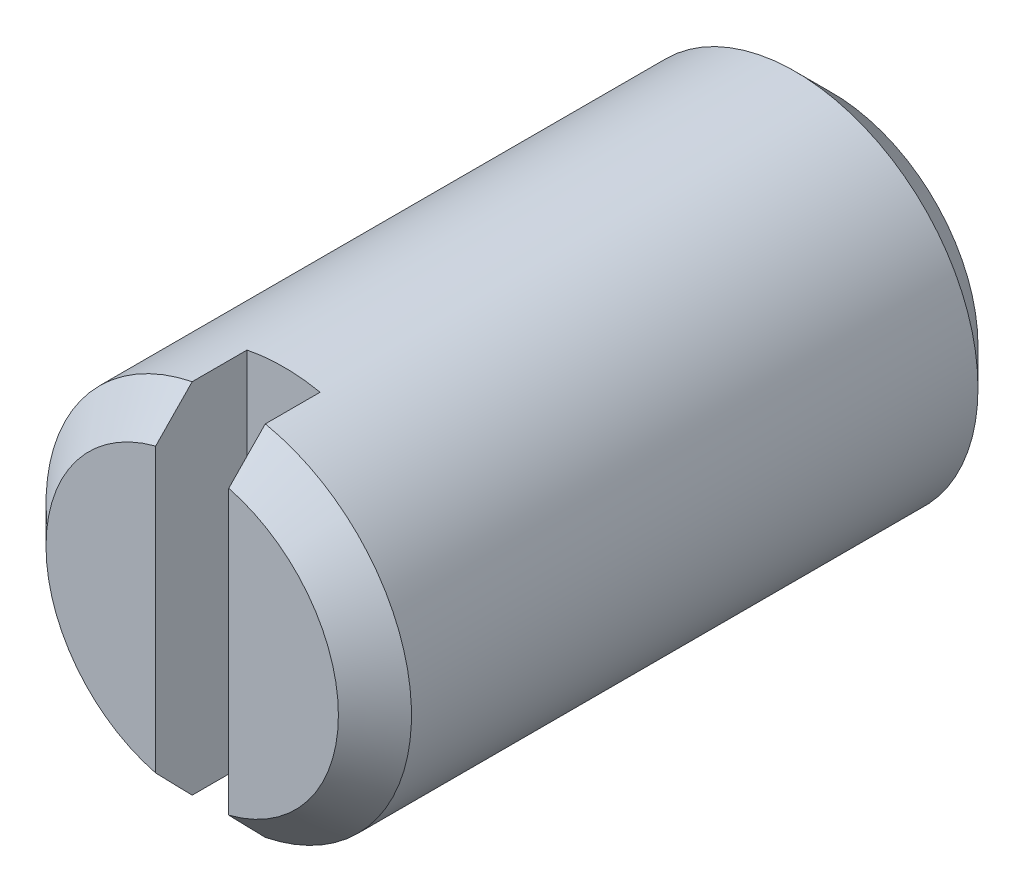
ISO-10303-21;
HEADER;
FILE_DESCRIPTION(('STEP AP214'),'2;1');
FILE_NAME('part.step','',(''),(''),'','','');
FILE_SCHEMA(('AUTOMOTIVE_DESIGN { 1 0 10303 214 1 1 1 1 }'));
ENDSEC;
DATA;
#1=APPLICATION_CONTEXT('core data for automotive mechanical design processes');
#2=APPLICATION_PROTOCOL_DEFINITION('international standard','automotive_design',2000,#1);
#3=PRODUCT_CONTEXT('',#1,'mechanical');
#4=PRODUCT('Part','Part','',(#3));
#5=PRODUCT_RELATED_PRODUCT_CATEGORY('part','',(#4));
#6=PRODUCT_DEFINITION_FORMATION('','',#4);
#7=PRODUCT_DEFINITION_CONTEXT('part definition',#1,'design');
#8=PRODUCT_DEFINITION('design','',#6,#7);
#9=PRODUCT_DEFINITION_SHAPE('','',#8);
#10=(LENGTH_UNIT() NAMED_UNIT(*) SI_UNIT(.MILLI.,.METRE.));
#11=(NAMED_UNIT(*) PLANE_ANGLE_UNIT() SI_UNIT($,.RADIAN.));
#12=(NAMED_UNIT(*) SI_UNIT($,.STERADIAN.) SOLID_ANGLE_UNIT());
#13=UNCERTAINTY_MEASURE_WITH_UNIT(LENGTH_MEASURE(1.E-05),#10,'distance_accuracy_value','');
#14=(GEOMETRIC_REPRESENTATION_CONTEXT(3) GLOBAL_UNCERTAINTY_ASSIGNED_CONTEXT((#13)) GLOBAL_UNIT_ASSIGNED_CONTEXT((#10,
#11,#12)) REPRESENTATION_CONTEXT('',''));
#15=CARTESIAN_POINT('',(0.,0.,0.));
#16=DIRECTION('',(0.,0.,1.));
#17=DIRECTION('',(1.,0.,0.));
#18=AXIS2_PLACEMENT_3D('',#15,#16,#17);
#19=CARTESIAN_POINT('',(0.,0.,3.5));
#20=DIRECTION('',(0.,0.,-1.));
#21=DIRECTION('',(-1.,0.,0.));
#22=AXIS2_PLACEMENT_3D('',#19,#20,#21);
#23=CYLINDRICAL_SURFACE('',#22,1.);
#24=CARTESIAN_POINT('',(0.,0.,0.200000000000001));
#25=DIRECTION('',(0.,0.,1.));
#26=DIRECTION('',(1.,0.,0.));
#27=AXIS2_PLACEMENT_3D('',#24,#25,#26);
#28=CIRCLE('',#27,1.);
#29=CARTESIAN_POINT('',(1.,0.,0.200000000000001));
#30=VERTEX_POINT('',#29);
#31=EDGE_CURVE('E147',#30,#30,#28,.T.);
#32=ORIENTED_EDGE('',*,*,#31,.T.);
#33=EDGE_LOOP('',(#32));
#34=FACE_BOUND('',#33,.T.);
#35=DIRECTION('',(0.,0.,-1.));
#36=VECTOR('',#35,1.);
#37=CARTESIAN_POINT('',(-0.2,0.979795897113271,3.5));
#38=LINE('',#37,#36);
#39=CARTESIAN_POINT('',(-0.2,0.979795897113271,3.));
#40=VERTEX_POINT('',#39);
#41=CARTESIAN_POINT('',(-0.2,0.979795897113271,3.3));
#42=VERTEX_POINT('',#41);
#43=EDGE_CURVE('E148',#40,#42,#38,.F.);
#44=ORIENTED_EDGE('',*,*,#43,.F.);
#45=CARTESIAN_POINT('',(0.,0.,3.));
#46=DIRECTION('',(0.,0.,1.));
#47=DIRECTION('',(1.,0.,0.));
#48=AXIS2_PLACEMENT_3D('',#45,#46,#47);
#49=CIRCLE('',#48,1.);
#50=CARTESIAN_POINT('',(0.2,0.979795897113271,3.));
#51=VERTEX_POINT('',#50);
#52=EDGE_CURVE('E11',#51,#40,#49,.T.);
#53=ORIENTED_EDGE('',*,*,#52,.F.);
#54=DIRECTION('',(0.,0.,-1.));
#55=VECTOR('',#54,1.);
#56=CARTESIAN_POINT('',(0.2,0.979795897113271,3.5));
#57=LINE('',#56,#55);
#58=CARTESIAN_POINT('',(0.2,0.979795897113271,3.3));
#59=VERTEX_POINT('',#58);
#60=EDGE_CURVE('E144',#59,#51,#57,.T.);
#61=ORIENTED_EDGE('',*,*,#60,.F.);
#62=CARTESIAN_POINT('',(0.,0.,3.3));
#63=DIRECTION('',(0.,0.,1.));
#64=DIRECTION('',(1.,0.,0.));
#65=AXIS2_PLACEMENT_3D('',#62,#63,#64);
#66=CIRCLE('',#65,1.);
#67=CARTESIAN_POINT('',(0.2,-0.979795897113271,3.3));
#68=VERTEX_POINT('',#67);
#69=EDGE_CURVE('E136',#59,#68,#66,.F.);
#70=ORIENTED_EDGE('',*,*,#69,.T.);
#71=DIRECTION('',(0.,0.,-1.));
#72=VECTOR('',#71,1.);
#73=CARTESIAN_POINT('',(0.2,-0.979795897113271,3.5));
#74=LINE('',#73,#72);
#75=CARTESIAN_POINT('',(0.2,-0.979795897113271,3.));
#76=VERTEX_POINT('',#75);
#77=EDGE_CURVE('E142',#76,#68,#74,.F.);
#78=ORIENTED_EDGE('',*,*,#77,.F.);
#79=CARTESIAN_POINT('',(-0.2,-0.979795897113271,3.));
#80=VERTEX_POINT('',#79);
#81=EDGE_CURVE('E32',#80,#76,#49,.T.);
#82=ORIENTED_EDGE('',*,*,#81,.F.);
#83=DIRECTION('',(0.,0.,-1.));
#84=VECTOR('',#83,1.);
#85=CARTESIAN_POINT('',(-0.2,-0.979795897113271,3.5));
#86=LINE('',#85,#84);
#87=CARTESIAN_POINT('',(-0.2,-0.979795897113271,3.3));
#88=VERTEX_POINT('',#87);
#89=EDGE_CURVE('E145',#88,#80,#86,.T.);
#90=ORIENTED_EDGE('',*,*,#89,.F.);
#91=EDGE_CURVE('E91',#88,#42,#66,.F.);
#92=ORIENTED_EDGE('',*,*,#91,.T.);
#93=EDGE_LOOP('',(#44,#53,#61,#70,#78,#82,#90,#92));
#94=FACE_BOUND('',#93,.T.);
#95=ADVANCED_FACE('F29',(#34,#94),#23,.T.);
#96=CARTESIAN_POINT('',(0.,0.,3.5));
#97=DIRECTION('',(0.,0.,1.));
#98=DIRECTION('',(1.,0.,0.));
#99=AXIS2_PLACEMENT_3D('',#96,#97,#98);
#100=PLANE('',#99);
#101=CARTESIAN_POINT('',(0.,0.,3.5));
#102=DIRECTION('',(0.,0.,1.));
#103=DIRECTION('',(1.,0.,0.));
#104=AXIS2_PLACEMENT_3D('',#101,#102,#103);
#105=CIRCLE('',#104,0.799999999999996);
#106=CARTESIAN_POINT('',(-0.2,0.77459666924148,3.5));
#107=VERTEX_POINT('',#106);
#108=CARTESIAN_POINT('',(-0.2,-0.77459666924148,3.5));
#109=VERTEX_POINT('',#108);
#110=EDGE_CURVE('E89',#107,#109,#105,.T.);
#111=ORIENTED_EDGE('',*,*,#110,.T.);
#112=DIRECTION('',(0.,1.,0.));
#113=VECTOR('',#112,1.);
#114=CARTESIAN_POINT('',(-0.2,-1.4,3.5));
#115=LINE('',#114,#113);
#116=EDGE_CURVE('E78',#109,#107,#115,.T.);
#117=ORIENTED_EDGE('',*,*,#116,.T.);
#118=EDGE_LOOP('',(#111,#117));
#119=FACE_BOUND('',#118,.T.);
#120=ADVANCED_FACE('F92',(#119),#100,.T.);
#121=CARTESIAN_POINT('',(0.2,-0.77459666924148,3.5));
#122=VERTEX_POINT('',#121);
#123=CARTESIAN_POINT('',(0.2,0.77459666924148,3.5));
#124=VERTEX_POINT('',#123);
#125=EDGE_CURVE('E94',#122,#124,#105,.T.);
#126=ORIENTED_EDGE('',*,*,#125,.T.);
#127=DIRECTION('',(0.,-1.,0.));
#128=VECTOR('',#127,1.);
#129=CARTESIAN_POINT('',(0.2,1.2,3.5));
#130=LINE('',#129,#128);
#131=EDGE_CURVE('E43',#124,#122,#130,.T.);
#132=ORIENTED_EDGE('',*,*,#131,.T.);
#133=EDGE_LOOP('',(#126,#132));
#134=FACE_BOUND('',#133,.T.);
#135=ADVANCED_FACE('F172',(#134),#100,.T.);
#136=CARTESIAN_POINT('',(0.,0.,3.5));
#137=DIRECTION('',(0.,0.,-1.));
#138=DIRECTION('',(-1.,0.,0.));
#139=AXIS2_PLACEMENT_3D('',#136,#137,#138);
#140=CONICAL_SURFACE('',#139,0.799999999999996,0.785398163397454);
#141=ORIENTED_EDGE('',*,*,#91,.F.);
#142=CARTESIAN_POINT('',(-0.2,-1.62590234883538,2.6618429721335));
#143=CARTESIAN_POINT('',(-0.2,-1.5636105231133,2.72366321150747));
#144=CARTESIAN_POINT('',(-0.2,-1.50129737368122,2.78546206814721));
#145=CARTESIAN_POINT('',(-0.2,-1.37659673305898,2.90897869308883));
#146=CARTESIAN_POINT('',(-0.2,-1.31420924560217,2.97069646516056));
#147=CARTESIAN_POINT('',(-0.2,-1.18933820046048,3.09400280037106));
#148=CARTESIAN_POINT('',(-0.2,-1.12685467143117,3.15559139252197));
#149=CARTESIAN_POINT('',(-0.2,-1.00170578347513,3.27859014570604));
#150=CARTESIAN_POINT('',(-0.2,-0.939040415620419,3.34000029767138));
#151=CARTESIAN_POINT('',(-0.2,-0.827245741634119,3.44898991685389));
#152=CARTESIAN_POINT('',(-0.2,-0.778178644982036,3.49663317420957));
#153=CARTESIAN_POINT('',(-0.2,-0.679728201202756,3.59158232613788));
#154=CARTESIAN_POINT('',(-0.2,-0.630344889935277,3.63888825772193));
#155=CARTESIAN_POINT('',(-0.2,-0.555796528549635,3.70936807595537));
#156=CARTESIAN_POINT('',(-0.2,-0.530862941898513,3.73278632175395));
#157=CARTESIAN_POINT('',(-0.2,-0.480767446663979,3.77937359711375));
#158=CARTESIAN_POINT('',(-0.2,-0.455605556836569,3.80254264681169));
#159=CARTESIAN_POINT('',(-0.2,-0.404921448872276,3.84850702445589));
#160=CARTESIAN_POINT('',(-0.2,-0.379399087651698,3.87130219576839));
#161=CARTESIAN_POINT('',(-0.2,-0.340679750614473,3.90500319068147));
#162=CARTESIAN_POINT('',(-0.2,-0.327698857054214,3.91615639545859));
#163=CARTESIAN_POINT('',(-0.2,-0.301538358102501,3.93823011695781));
#164=CARTESIAN_POINT('',(-0.2,-0.288358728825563,3.94915060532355));
#165=CARTESIAN_POINT('',(-0.2,-0.27505401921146,3.95991954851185));
#166=B_SPLINE_CURVE_WITH_KNOTS('',3,(#142,#143,#144,#145,#146,#147,#148,#149,#150,#151,#152,
#153,#154,#155,#156,#157,#158,#159,#160,#161,#162,#163,#164,#165),.UNSPECIFIED.,.F.,.F.,(4,2,2,
2,2,2,2,2,2,2,2,4),(0.,0.263283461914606,0.526554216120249,0.789757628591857,1.05297419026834,
1.25814953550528,1.46330201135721,1.56592093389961,1.66853150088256,1.77118401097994,
1.82252439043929,1.87387099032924),.UNSPECIFIED.);
#167=EDGE_CURVE('E51',#88,#109,#166,.T.);
#168=ORIENTED_EDGE('',*,*,#167,.T.);
#169=ORIENTED_EDGE('',*,*,#110,.F.);
#170=CARTESIAN_POINT('',(-0.2,0.27505401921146,3.95991954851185));
#171=CARTESIAN_POINT('',(-0.2,0.287984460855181,3.94945412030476));
#172=CARTESIAN_POINT('',(-0.2,0.30079644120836,3.93884505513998));
#173=CARTESIAN_POINT('',(-0.2,0.326231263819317,3.91740515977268));
#174=CARTESIAN_POINT('',(-0.2,0.33885412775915,3.90657435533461));
#175=CARTESIAN_POINT('',(-0.2,0.376508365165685,3.87384977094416));
#176=CARTESIAN_POINT('',(-0.2,0.401332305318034,3.85171810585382));
#177=CARTESIAN_POINT('',(-0.2,0.450630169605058,3.80709112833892));
#178=CARTESIAN_POINT('',(-0.2,0.475104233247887,3.78459596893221));
#179=CARTESIAN_POINT('',(-0.2,0.523828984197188,3.73936147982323));
#180=CARTESIAN_POINT('',(-0.2,0.548079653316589,3.71662213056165));
#181=CARTESIAN_POINT('',(-0.2,0.623380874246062,3.64554271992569));
#182=CARTESIAN_POINT('',(-0.2,0.674168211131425,3.59692435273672));
#183=CARTESIAN_POINT('',(-0.2,0.775409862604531,3.49932148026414));
#184=CARTESIAN_POINT('',(-0.2,0.825864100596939,3.45033689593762));
#185=CARTESIAN_POINT('',(-0.2,0.939066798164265,3.33997457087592));
#186=CARTESIAN_POINT('',(-0.2,1.00175843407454,3.27853855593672));
#187=CARTESIAN_POINT('',(-0.2,1.12696288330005,3.1554848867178));
#188=CARTESIAN_POINT('',(-0.2,1.1894756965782,3.0938672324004));
#189=CARTESIAN_POINT('',(-0.2,1.31434978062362,2.97055748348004));
#190=CARTESIAN_POINT('',(-0.2,1.37671112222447,2.90886546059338));
#191=CARTESIAN_POINT('',(-0.2,1.50135619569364,2.78540373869));
#192=CARTESIAN_POINT('',(-0.2,1.56363992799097,2.72363404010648));
#193=CARTESIAN_POINT('',(-0.2,1.62590234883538,2.6618429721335));
#194=B_SPLINE_CURVE_WITH_KNOTS('',3,(#170,#171,#172,#173,#174,#175,#176,#177,#178,#179,#180,
#181,#182,#183,#184,#185,#186,#187,#188,#189,#190,#191,#192,#193),.UNSPECIFIED.,.F.,.F.,(4,2,2,
2,2,2,2,2,2,2,2,4),(0.,0.0499013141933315,0.0997968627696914,0.199561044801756,
0.299284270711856,0.399015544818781,0.609932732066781,0.820896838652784,1.08422397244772,
1.34755116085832,1.6107118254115,1.87387102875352),.UNSPECIFIED.);
#195=EDGE_CURVE('E81',#107,#42,#194,.T.);
#196=ORIENTED_EDGE('',*,*,#195,.T.);
#197=EDGE_LOOP('',(#141,#168,#169,#196));
#198=FACE_BOUND('',#197,.T.);
#199=ADVANCED_FACE('F88',(#198),#140,.T.);
#200=ORIENTED_EDGE('',*,*,#125,.F.);
#201=CARTESIAN_POINT('',(0.2,-0.27505401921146,3.95991954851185));
#202=CARTESIAN_POINT('',(0.2,-0.287984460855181,3.94945412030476));
#203=CARTESIAN_POINT('',(0.2,-0.30079644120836,3.93884505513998));
#204=CARTESIAN_POINT('',(0.2,-0.326231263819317,3.91740515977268));
#205=CARTESIAN_POINT('',(0.2,-0.33885412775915,3.90657435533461));
#206=CARTESIAN_POINT('',(0.2,-0.376508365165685,3.87384977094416));
#207=CARTESIAN_POINT('',(0.2,-0.401332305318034,3.85171810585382));
#208=CARTESIAN_POINT('',(0.2,-0.450630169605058,3.80709112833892));
#209=CARTESIAN_POINT('',(0.2,-0.475104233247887,3.78459596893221));
#210=CARTESIAN_POINT('',(0.2,-0.523828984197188,3.73936147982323));
#211=CARTESIAN_POINT('',(0.2,-0.548079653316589,3.71662213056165));
#212=CARTESIAN_POINT('',(0.2,-0.623380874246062,3.64554271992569));
#213=CARTESIAN_POINT('',(0.2,-0.674168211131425,3.59692435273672));
#214=CARTESIAN_POINT('',(0.2,-0.775409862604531,3.49932148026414));
#215=CARTESIAN_POINT('',(0.2,-0.825864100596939,3.45033689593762));
#216=CARTESIAN_POINT('',(0.2,-0.939066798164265,3.33997457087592));
#217=CARTESIAN_POINT('',(0.2,-1.00175843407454,3.27853855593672));
#218=CARTESIAN_POINT('',(0.2,-1.12696288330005,3.1554848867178));
#219=CARTESIAN_POINT('',(0.2,-1.1894756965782,3.0938672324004));
#220=CARTESIAN_POINT('',(0.2,-1.31434978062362,2.97055748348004));
#221=CARTESIAN_POINT('',(0.2,-1.37671112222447,2.90886546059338));
#222=CARTESIAN_POINT('',(0.2,-1.50135619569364,2.78540373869));
#223=CARTESIAN_POINT('',(0.2,-1.56363992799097,2.72363404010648));
#224=CARTESIAN_POINT('',(0.2,-1.62590234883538,2.6618429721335));
#225=B_SPLINE_CURVE_WITH_KNOTS('',3,(#201,#202,#203,#204,#205,#206,#207,#208,#209,#210,#211,
#212,#213,#214,#215,#216,#217,#218,#219,#220,#221,#222,#223,#224),.UNSPECIFIED.,.F.,.F.,(4,2,2,
2,2,2,2,2,2,2,2,4),(0.,0.0499013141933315,0.0997968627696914,0.199561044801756,
0.299284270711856,0.399015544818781,0.609932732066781,0.820896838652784,1.08422397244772,
1.34755116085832,1.6107118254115,1.87387102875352),.UNSPECIFIED.);
#226=EDGE_CURVE('E96',#122,#68,#225,.T.);
#227=ORIENTED_EDGE('',*,*,#226,.T.);
#228=ORIENTED_EDGE('',*,*,#69,.F.);
#229=CARTESIAN_POINT('',(0.2,1.62590234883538,2.6618429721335));
#230=CARTESIAN_POINT('',(0.2,1.5636105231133,2.72366321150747));
#231=CARTESIAN_POINT('',(0.2,1.50129737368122,2.78546206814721));
#232=CARTESIAN_POINT('',(0.2,1.37659673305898,2.90897869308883));
#233=CARTESIAN_POINT('',(0.2,1.31420924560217,2.97069646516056));
#234=CARTESIAN_POINT('',(0.2,1.18933820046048,3.09400280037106));
#235=CARTESIAN_POINT('',(0.2,1.12685467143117,3.15559139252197));
#236=CARTESIAN_POINT('',(0.2,1.00170578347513,3.27859014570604));
#237=CARTESIAN_POINT('',(0.2,0.939040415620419,3.34000029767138));
#238=CARTESIAN_POINT('',(0.2,0.827245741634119,3.44898991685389));
#239=CARTESIAN_POINT('',(0.2,0.778178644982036,3.49663317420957));
#240=CARTESIAN_POINT('',(0.2,0.679728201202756,3.59158232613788));
#241=CARTESIAN_POINT('',(0.2,0.630344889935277,3.63888825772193));
#242=CARTESIAN_POINT('',(0.2,0.555796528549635,3.70936807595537));
#243=CARTESIAN_POINT('',(0.2,0.530862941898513,3.73278632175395));
#244=CARTESIAN_POINT('',(0.2,0.480767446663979,3.77937359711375));
#245=CARTESIAN_POINT('',(0.2,0.455605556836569,3.80254264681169));
#246=CARTESIAN_POINT('',(0.2,0.404921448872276,3.84850702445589));
#247=CARTESIAN_POINT('',(0.2,0.379399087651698,3.87130219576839));
#248=CARTESIAN_POINT('',(0.2,0.340679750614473,3.90500319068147));
#249=CARTESIAN_POINT('',(0.2,0.327698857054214,3.91615639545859));
#250=CARTESIAN_POINT('',(0.2,0.301538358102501,3.93823011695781));
#251=CARTESIAN_POINT('',(0.2,0.288358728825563,3.94915060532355));
#252=CARTESIAN_POINT('',(0.2,0.27505401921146,3.95991954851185));
#253=B_SPLINE_CURVE_WITH_KNOTS('',3,(#229,#230,#231,#232,#233,#234,#235,#236,#237,#238,#239,
#240,#241,#242,#243,#244,#245,#246,#247,#248,#249,#250,#251,#252),.UNSPECIFIED.,.F.,.F.,(4,2,2,
2,2,2,2,2,2,2,2,4),(0.,0.263283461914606,0.526554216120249,0.789757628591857,1.05297419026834,
1.25814953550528,1.46330201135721,1.56592093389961,1.66853150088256,1.77118401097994,
1.82252439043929,1.87387099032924),.UNSPECIFIED.);
#254=EDGE_CURVE('E93',#59,#124,#253,.T.);
#255=ORIENTED_EDGE('',*,*,#254,.T.);
#256=EDGE_LOOP('',(#200,#227,#228,#255));
#257=FACE_BOUND('',#256,.T.);
#258=ADVANCED_FACE('F135',(#257),#140,.T.);
#259=CARTESIAN_POINT('',(0.,0.,0.));
#260=DIRECTION('',(0.,0.,1.));
#261=DIRECTION('',(1.,0.,0.));
#262=AXIS2_PLACEMENT_3D('',#259,#260,#261);
#263=PLANE('',#262);
#264=CARTESIAN_POINT('',(0.,0.,0.));
#265=DIRECTION('',(0.,0.,1.));
#266=DIRECTION('',(1.,0.,0.));
#267=AXIS2_PLACEMENT_3D('',#264,#265,#266);
#268=CIRCLE('',#267,0.799999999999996);
#269=CARTESIAN_POINT('',(0.799999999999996,0.,0.));
#270=VERTEX_POINT('',#269);
#271=EDGE_CURVE('E99',#270,#270,#268,.F.);
#272=ORIENTED_EDGE('',*,*,#271,.T.);
#273=EDGE_LOOP('',(#272));
#274=FACE_BOUND('',#273,.T.);
#275=ADVANCED_FACE('F157',(#274),#263,.F.);
#276=CARTESIAN_POINT('',(0.,0.,0.200000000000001));
#277=DIRECTION('',(0.,0.,1.));
#278=DIRECTION('',(1.,0.,0.));
#279=AXIS2_PLACEMENT_3D('',#276,#277,#278);
#280=CONICAL_SURFACE('',#279,1.,0.785398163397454);
#281=ORIENTED_EDGE('',*,*,#271,.F.);
#282=EDGE_LOOP('',(#281));
#283=FACE_BOUND('',#282,.T.);
#284=ORIENTED_EDGE('',*,*,#31,.F.);
#285=EDGE_LOOP('',(#284));
#286=FACE_BOUND('',#285,.T.);
#287=ADVANCED_FACE('F159',(#283,#286),#280,.T.);
#288=CARTESIAN_POINT('',(-0.2,1.2,3.));
#289=DIRECTION('',(0.,0.,1.));
#290=DIRECTION('',(1.,0.,0.));
#291=AXIS2_PLACEMENT_3D('',#288,#289,#290);
#292=PLANE('',#291);
#293=ORIENTED_EDGE('',*,*,#52,.T.);
#294=DIRECTION('',(0.,1.,0.));
#295=VECTOR('',#294,1.);
#296=CARTESIAN_POINT('',(-0.2,-1.4,3.));
#297=LINE('',#296,#295);
#298=EDGE_CURVE('E180',#80,#40,#297,.T.);
#299=ORIENTED_EDGE('',*,*,#298,.F.);
#300=ORIENTED_EDGE('',*,*,#81,.T.);
#301=DIRECTION('',(0.,-1.,0.));
#302=VECTOR('',#301,1.);
#303=CARTESIAN_POINT('',(0.2,1.2,3.));
#304=LINE('',#303,#302);
#305=EDGE_CURVE('E183',#51,#76,#304,.T.);
#306=ORIENTED_EDGE('',*,*,#305,.F.);
#307=EDGE_LOOP('',(#293,#299,#300,#306));
#308=FACE_BOUND('',#307,.T.);
#309=ADVANCED_FACE('F119',(#308),#292,.T.);
#310=CARTESIAN_POINT('',(-0.2,-1.4,3.));
#311=DIRECTION('',(1.,0.,0.));
#312=DIRECTION('',(0.,0.,-1.));
#313=AXIS2_PLACEMENT_3D('',#310,#311,#312);
#314=PLANE('',#313);
#315=ORIENTED_EDGE('',*,*,#89,.T.);
#316=ORIENTED_EDGE('',*,*,#298,.T.);
#317=ORIENTED_EDGE('',*,*,#43,.T.);
#318=ORIENTED_EDGE('',*,*,#195,.F.);
#319=ORIENTED_EDGE('',*,*,#116,.F.);
#320=ORIENTED_EDGE('',*,*,#167,.F.);
#321=EDGE_LOOP('',(#315,#316,#317,#318,#319,#320));
#322=FACE_BOUND('',#321,.T.);
#323=ADVANCED_FACE('F79',(#322),#314,.T.);
#324=CARTESIAN_POINT('',(0.2,1.2,3.));
#325=DIRECTION('',(-1.,0.,0.));
#326=DIRECTION('',(0.,0.,1.));
#327=AXIS2_PLACEMENT_3D('',#324,#325,#326);
#328=PLANE('',#327);
#329=ORIENTED_EDGE('',*,*,#77,.T.);
#330=ORIENTED_EDGE('',*,*,#226,.F.);
#331=ORIENTED_EDGE('',*,*,#131,.F.);
#332=ORIENTED_EDGE('',*,*,#254,.F.);
#333=ORIENTED_EDGE('',*,*,#60,.T.);
#334=ORIENTED_EDGE('',*,*,#305,.T.);
#335=EDGE_LOOP('',(#329,#330,#331,#332,#333,#334));
#336=FACE_BOUND('',#335,.T.);
#337=ADVANCED_FACE('F115',(#336),#328,.T.);
#338=CLOSED_SHELL('',(#95,#120,#135,#199,#258,#275,#287,#309,#323,#337));
#339=MANIFOLD_SOLID_BREP('B2',#338);
#340=ADVANCED_BREP_SHAPE_REPRESENTATION('',(#18,#339),#14);
#341=SHAPE_DEFINITION_REPRESENTATION(#9,#340);
ENDSEC;
END-ISO-10303-21;
